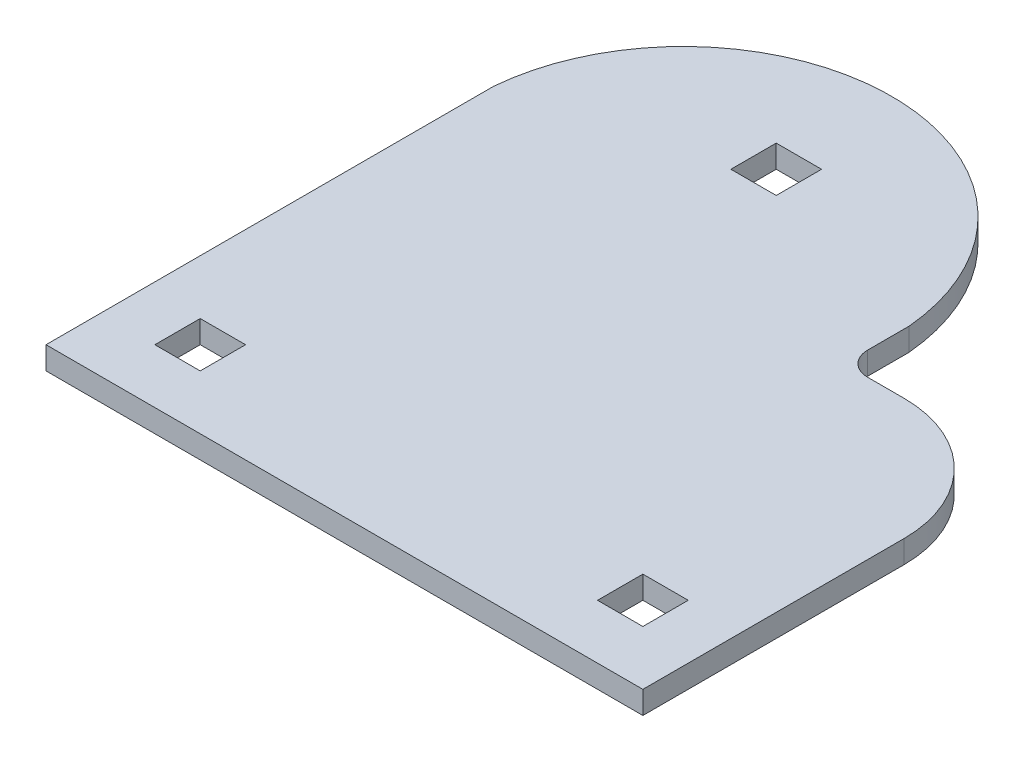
ISO-10303-21;
HEADER;
FILE_DESCRIPTION(('STEP AP214'),'2;1');
FILE_NAME('part.step','',(''),(''),'','','');
FILE_SCHEMA(('AUTOMOTIVE_DESIGN { 1 0 10303 214 1 1 1 1 }'));
ENDSEC;
DATA;
#1=APPLICATION_CONTEXT('core data for automotive mechanical design processes');
#2=APPLICATION_PROTOCOL_DEFINITION('international standard','automotive_design',2000,#1);
#3=PRODUCT_CONTEXT('',#1,'mechanical');
#4=PRODUCT('Part','Part','',(#3));
#5=PRODUCT_RELATED_PRODUCT_CATEGORY('part','',(#4));
#6=PRODUCT_DEFINITION_FORMATION('','',#4);
#7=PRODUCT_DEFINITION_CONTEXT('part definition',#1,'design');
#8=PRODUCT_DEFINITION('design','',#6,#7);
#9=PRODUCT_DEFINITION_SHAPE('','',#8);
#10=(LENGTH_UNIT() NAMED_UNIT(*) SI_UNIT(.MILLI.,.METRE.));
#11=(NAMED_UNIT(*) PLANE_ANGLE_UNIT() SI_UNIT($,.RADIAN.));
#12=(NAMED_UNIT(*) SI_UNIT($,.STERADIAN.) SOLID_ANGLE_UNIT());
#13=UNCERTAINTY_MEASURE_WITH_UNIT(LENGTH_MEASURE(1.E-05),#10,'distance_accuracy_value','');
#14=(GEOMETRIC_REPRESENTATION_CONTEXT(3) GLOBAL_UNCERTAINTY_ASSIGNED_CONTEXT((#13)) GLOBAL_UNIT_ASSIGNED_CONTEXT((#10,
#11,#12)) REPRESENTATION_CONTEXT('',''));
#15=CARTESIAN_POINT('',(0.,0.,0.));
#16=DIRECTION('',(0.,0.,1.));
#17=DIRECTION('',(1.,0.,0.));
#18=AXIS2_PLACEMENT_3D('',#15,#16,#17);
#19=CARTESIAN_POINT('',(6.85799999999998,3.175,0.));
#20=DIRECTION('',(1.,0.,0.));
#21=DIRECTION('',(0.,0.,-1.));
#22=AXIS2_PLACEMENT_3D('',#19,#20,#21);
#23=PLANE('',#22);
#24=DIRECTION('',(0.,0.,1.));
#25=VECTOR('',#24,1.);
#26=CARTESIAN_POINT('',(6.85799999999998,0.,0.));
#27=LINE('',#26,#25);
#28=CARTESIAN_POINT('',(6.858,0.,10.16));
#29=VERTEX_POINT('',#28);
#30=CARTESIAN_POINT('',(6.858,0.,46.7151803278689));
#31=VERTEX_POINT('',#30);
#32=EDGE_CURVE('E284',#29,#31,#27,.T.);
#33=ORIENTED_EDGE('',*,*,#32,.F.);
#34=DIRECTION('',(0.,-1.,0.));
#35=VECTOR('',#34,1.);
#36=CARTESIAN_POINT('',(6.858,3.175,10.16));
#37=LINE('',#36,#35);
#38=CARTESIAN_POINT('',(6.858,3.175,10.16));
#39=VERTEX_POINT('',#38);
#40=EDGE_CURVE('E288',#39,#29,#37,.T.);
#41=ORIENTED_EDGE('',*,*,#40,.F.);
#42=DIRECTION('',(0.,0.,1.));
#43=VECTOR('',#42,1.);
#44=CARTESIAN_POINT('',(6.85799999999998,3.175,0.));
#45=LINE('',#44,#43);
#46=CARTESIAN_POINT('',(6.858,3.175,46.7151803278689));
#47=VERTEX_POINT('',#46);
#48=EDGE_CURVE('E276',#39,#47,#45,.T.);
#49=ORIENTED_EDGE('',*,*,#48,.T.);
#50=DIRECTION('',(0.,-1.,0.));
#51=VECTOR('',#50,1.);
#52=CARTESIAN_POINT('',(6.858,3.175,46.7151803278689));
#53=LINE('',#52,#51);
#54=EDGE_CURVE('E44',#47,#31,#53,.T.);
#55=ORIENTED_EDGE('',*,*,#54,.T.);
#56=EDGE_LOOP('',(#33,#41,#49,#55));
#57=FACE_BOUND('',#56,.T.);
#58=ADVANCED_FACE('F35',(#57),#23,.T.);
#59=CARTESIAN_POINT('',(-76.708,3.175,0.));
#60=DIRECTION('',(1.,0.,0.));
#61=DIRECTION('',(0.,0.,-1.));
#62=AXIS2_PLACEMENT_3D('',#59,#60,#61);
#63=PLANE('',#62);
#64=DIRECTION('',(0.,0.,1.));
#65=VECTOR('',#64,1.);
#66=CARTESIAN_POINT('',(-76.708,0.,0.));
#67=LINE('',#66,#65);
#68=CARTESIAN_POINT('',(-76.708,0.,-15.9537511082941));
#69=VERTEX_POINT('',#68);
#70=CARTESIAN_POINT('',(-76.708,0.,46.7151803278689));
#71=VERTEX_POINT('',#70);
#72=EDGE_CURVE('E287',#69,#71,#67,.T.);
#73=ORIENTED_EDGE('',*,*,#72,.T.);
#74=DIRECTION('',(0.,-1.,0.));
#75=VECTOR('',#74,1.);
#76=CARTESIAN_POINT('',(-76.708,3.175,46.7151803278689));
#77=LINE('',#76,#75);
#78=CARTESIAN_POINT('',(-76.708,3.175,46.7151803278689));
#79=VERTEX_POINT('',#78);
#80=EDGE_CURVE('E11',#79,#71,#77,.T.);
#81=ORIENTED_EDGE('',*,*,#80,.F.);
#82=DIRECTION('',(0.,0.,1.));
#83=VECTOR('',#82,1.);
#84=CARTESIAN_POINT('',(-76.708,3.175,0.));
#85=LINE('',#84,#83);
#86=CARTESIAN_POINT('',(-76.708,3.175,-15.9537511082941));
#87=VERTEX_POINT('',#86);
#88=EDGE_CURVE('E279',#87,#79,#85,.T.);
#89=ORIENTED_EDGE('',*,*,#88,.F.);
#90=DIRECTION('',(0.,-1.,0.));
#91=VECTOR('',#90,1.);
#92=CARTESIAN_POINT('',(-76.708,3.175,-15.9537511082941));
#93=LINE('',#92,#91);
#94=EDGE_CURVE('E39',#87,#69,#93,.T.);
#95=ORIENTED_EDGE('',*,*,#94,.T.);
#96=EDGE_LOOP('',(#73,#81,#89,#95));
#97=FACE_BOUND('',#96,.T.);
#98=ADVANCED_FACE('F333',(#97),#63,.F.);
#99=CARTESIAN_POINT('',(0.,3.175,46.7151803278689));
#100=DIRECTION('',(0.,0.,-1.));
#101=DIRECTION('',(-1.,0.,0.));
#102=AXIS2_PLACEMENT_3D('',#99,#100,#101);
#103=PLANE('',#102);
#104=DIRECTION('',(1.,0.,0.));
#105=VECTOR('',#104,1.);
#106=CARTESIAN_POINT('',(0.,0.,46.7151803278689));
#107=LINE('',#106,#105);
#108=EDGE_CURVE('E280',#71,#31,#107,.T.);
#109=ORIENTED_EDGE('',*,*,#108,.T.);
#110=ORIENTED_EDGE('',*,*,#54,.F.);
#111=DIRECTION('',(1.,0.,0.));
#112=VECTOR('',#111,1.);
#113=CARTESIAN_POINT('',(0.,3.175,46.7151803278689));
#114=LINE('',#113,#112);
#115=EDGE_CURVE('E282',#79,#47,#114,.T.);
#116=ORIENTED_EDGE('',*,*,#115,.F.);
#117=ORIENTED_EDGE('',*,*,#80,.T.);
#118=EDGE_LOOP('',(#109,#110,#116,#117));
#119=FACE_BOUND('',#118,.T.);
#120=ADVANCED_FACE('F360',(#119),#103,.F.);
#121=CARTESIAN_POINT('',(0.,3.175,0.));
#122=DIRECTION('',(0.,1.,0.));
#123=DIRECTION('',(0.,0.,1.));
#124=AXIS2_PLACEMENT_3D('',#121,#122,#123);
#125=PLANE('',#124);
#126=DIRECTION('',(0.,0.,-1.));
#127=VECTOR('',#126,1.);
#128=CARTESIAN_POINT('',(-62.738,3.175,0.));
#129=LINE('',#128,#127);
#130=CARTESIAN_POINT('',(-62.738,3.175,39.0951803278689));
#131=VERTEX_POINT('',#130);
#132=CARTESIAN_POINT('',(-62.738,3.175,32.7451803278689));
#133=VERTEX_POINT('',#132);
#134=EDGE_CURVE('E179',#131,#133,#129,.T.);
#135=ORIENTED_EDGE('',*,*,#134,.F.);
#136=DIRECTION('',(1.,0.,0.));
#137=VECTOR('',#136,1.);
#138=CARTESIAN_POINT('',(0.,3.175,39.0951803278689));
#139=LINE('',#138,#137);
#140=CARTESIAN_POINT('',(-69.088,3.175,39.0951803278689));
#141=VERTEX_POINT('',#140);
#142=EDGE_CURVE('E272',#141,#131,#139,.T.);
#143=ORIENTED_EDGE('',*,*,#142,.F.);
#144=DIRECTION('',(0.,0.,1.));
#145=VECTOR('',#144,1.);
#146=CARTESIAN_POINT('',(-69.088,3.175,0.));
#147=LINE('',#146,#145);
#148=CARTESIAN_POINT('',(-69.088,3.175,32.7451803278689));
#149=VERTEX_POINT('',#148);
#150=EDGE_CURVE('E270',#149,#141,#147,.T.);
#151=ORIENTED_EDGE('',*,*,#150,.F.);
#152=DIRECTION('',(-1.,0.,0.));
#153=VECTOR('',#152,1.);
#154=CARTESIAN_POINT('',(0.,3.175,32.7451803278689));
#155=LINE('',#154,#153);
#156=EDGE_CURVE('E268',#133,#149,#155,.T.);
#157=ORIENTED_EDGE('',*,*,#156,.F.);
#158=EDGE_LOOP('',(#135,#143,#151,#157));
#159=FACE_BOUND('',#158,.T.);
#160=DIRECTION('',(0.,0.,-1.));
#161=VECTOR('',#160,1.);
#162=CARTESIAN_POINT('',(-0.761999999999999,3.175,0.));
#163=LINE('',#162,#161);
#164=CARTESIAN_POINT('',(-0.761999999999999,3.175,39.0951803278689));
#165=VERTEX_POINT('',#164);
#166=CARTESIAN_POINT('',(-0.761999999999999,3.175,32.7451803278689));
#167=VERTEX_POINT('',#166);
#168=EDGE_CURVE('E266',#165,#167,#163,.T.);
#169=ORIENTED_EDGE('',*,*,#168,.F.);
#170=DIRECTION('',(1.,0.,0.));
#171=VECTOR('',#170,1.);
#172=CARTESIAN_POINT('',(0.,3.175,39.0951803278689));
#173=LINE('',#172,#171);
#174=CARTESIAN_POINT('',(-7.11200000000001,3.175,39.0951803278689));
#175=VERTEX_POINT('',#174);
#176=EDGE_CURVE('E264',#175,#165,#173,.T.);
#177=ORIENTED_EDGE('',*,*,#176,.F.);
#178=DIRECTION('',(0.,0.,1.));
#179=VECTOR('',#178,1.);
#180=CARTESIAN_POINT('',(-7.11200000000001,3.175,0.));
#181=LINE('',#180,#179);
#182=CARTESIAN_POINT('',(-7.11200000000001,3.175,32.7451803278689));
#183=VERTEX_POINT('',#182);
#184=EDGE_CURVE('E262',#183,#175,#181,.T.);
#185=ORIENTED_EDGE('',*,*,#184,.F.);
#186=DIRECTION('',(-1.,0.,0.));
#187=VECTOR('',#186,1.);
#188=CARTESIAN_POINT('',(0.,3.175,32.7451803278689));
#189=LINE('',#188,#187);
#190=EDGE_CURVE('E260',#167,#183,#189,.T.);
#191=ORIENTED_EDGE('',*,*,#190,.F.);
#192=EDGE_LOOP('',(#169,#177,#185,#191));
#193=FACE_BOUND('',#192,.T.);
#194=DIRECTION('',(0.,0.,-1.));
#195=VECTOR('',#194,1.);
#196=CARTESIAN_POINT('',(-43.688,3.175,0.));
#197=LINE('',#196,#195);
#198=CARTESIAN_POINT('',(-43.688,3.175,-22.4998196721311));
#199=VERTEX_POINT('',#198);
#200=CARTESIAN_POINT('',(-43.688,3.175,-28.8498196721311));
#201=VERTEX_POINT('',#200);
#202=EDGE_CURVE('E257',#199,#201,#197,.T.);
#203=ORIENTED_EDGE('',*,*,#202,.F.);
#204=DIRECTION('',(1.,0.,0.));
#205=VECTOR('',#204,1.);
#206=CARTESIAN_POINT('',(0.,3.175,-22.4998196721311));
#207=LINE('',#206,#205);
#208=CARTESIAN_POINT('',(-50.038,3.175,-22.4998196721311));
#209=VERTEX_POINT('',#208);
#210=EDGE_CURVE('E255',#209,#199,#207,.T.);
#211=ORIENTED_EDGE('',*,*,#210,.F.);
#212=DIRECTION('',(0.,0.,1.));
#213=VECTOR('',#212,1.);
#214=CARTESIAN_POINT('',(-50.038,3.175,0.));
#215=LINE('',#214,#213);
#216=CARTESIAN_POINT('',(-50.038,3.175,-28.8498196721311));
#217=VERTEX_POINT('',#216);
#218=EDGE_CURVE('E253',#217,#209,#215,.T.);
#219=ORIENTED_EDGE('',*,*,#218,.F.);
#220=DIRECTION('',(-1.,0.,0.));
#221=VECTOR('',#220,1.);
#222=CARTESIAN_POINT('',(0.,3.175,-28.8498196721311));
#223=LINE('',#222,#221);
#224=EDGE_CURVE('E206',#201,#217,#223,.T.);
#225=ORIENTED_EDGE('',*,*,#224,.F.);
#226=EDGE_LOOP('',(#203,#211,#219,#225));
#227=FACE_BOUND('',#226,.T.);
#228=ORIENTED_EDGE('',*,*,#48,.F.);
#229=CARTESIAN_POINT('',(-10.16,3.175,10.16));
#230=DIRECTION('',(0.,1.,0.));
#231=DIRECTION('',(0.,0.,1.));
#232=AXIS2_PLACEMENT_3D('',#229,#230,#231);
#233=CIRCLE('',#232,17.018);
#234=CARTESIAN_POINT('',(-10.16,3.175,-6.858));
#235=VERTEX_POINT('',#234);
#236=EDGE_CURVE('E304',#39,#235,#233,.T.);
#237=ORIENTED_EDGE('',*,*,#236,.T.);
#238=DIRECTION('',(-1.,0.,0.));
#239=VECTOR('',#238,1.);
#240=CARTESIAN_POINT('',(-10.16,3.175,-6.858));
#241=LINE('',#240,#239);
#242=CARTESIAN_POINT('',(-15.24,3.175,-6.858));
#243=VERTEX_POINT('',#242);
#244=EDGE_CURVE('E302',#235,#243,#241,.T.);
#245=ORIENTED_EDGE('',*,*,#244,.T.);
#246=CARTESIAN_POINT('',(-15.24,3.175,-10.16));
#247=DIRECTION('',(0.,-1.,0.));
#248=DIRECTION('',(0.,0.,-1.));
#249=AXIS2_PLACEMENT_3D('',#246,#247,#248);
#250=CIRCLE('',#249,3.302);
#251=CARTESIAN_POINT('',(-18.542,3.175,-10.16));
#252=VERTEX_POINT('',#251);
#253=EDGE_CURVE('E300',#243,#252,#250,.T.);
#254=ORIENTED_EDGE('',*,*,#253,.T.);
#255=DIRECTION('',(0.,0.,1.));
#256=VECTOR('',#255,1.);
#257=CARTESIAN_POINT('',(-18.5419999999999,3.175,-15.9537511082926));
#258=LINE('',#257,#256);
#259=CARTESIAN_POINT('',(-18.5419999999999,3.175,-15.9537511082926));
#260=VERTEX_POINT('',#259);
#261=EDGE_CURVE('E296',#260,#252,#258,.T.);
#262=ORIENTED_EDGE('',*,*,#261,.F.);
#263=CARTESIAN_POINT('',(-47.625,3.175,-13.4125578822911));
#264=DIRECTION('',(0.,1.,0.));
#265=DIRECTION('',(0.,0.,1.));
#266=AXIS2_PLACEMENT_3D('',#263,#264,#265);
#267=CIRCLE('',#266,29.1938101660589);
#268=EDGE_CURVE('E293',#260,#87,#267,.T.);
#269=ORIENTED_EDGE('',*,*,#268,.T.);
#270=ORIENTED_EDGE('',*,*,#88,.T.);
#271=ORIENTED_EDGE('',*,*,#115,.T.);
#272=EDGE_LOOP('',(#228,#237,#245,#254,#262,#269,#270,#271));
#273=FACE_BOUND('',#272,.T.);
#274=ADVANCED_FACE('F363',(#159,#193,#227,#273),#125,.T.);
#275=CARTESIAN_POINT('',(0.,0.,0.));
#276=DIRECTION('',(0.,1.,0.));
#277=DIRECTION('',(0.,0.,1.));
#278=AXIS2_PLACEMENT_3D('',#275,#276,#277);
#279=PLANE('',#278);
#280=DIRECTION('',(1.,0.,0.));
#281=VECTOR('',#280,1.);
#282=CARTESIAN_POINT('',(-69.088,0.,39.0951803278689));
#283=LINE('',#282,#281);
#284=CARTESIAN_POINT('',(-69.088,0.,39.0951803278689));
#285=VERTEX_POINT('',#284);
#286=CARTESIAN_POINT('',(-62.738,0.,39.0951803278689));
#287=VERTEX_POINT('',#286);
#288=EDGE_CURVE('E182',#285,#287,#283,.T.);
#289=ORIENTED_EDGE('',*,*,#288,.T.);
#290=DIRECTION('',(0.,0.,-1.));
#291=VECTOR('',#290,1.);
#292=CARTESIAN_POINT('',(-62.738,0.,39.0951803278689));
#293=LINE('',#292,#291);
#294=CARTESIAN_POINT('',(-62.738,0.,32.7451803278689));
#295=VERTEX_POINT('',#294);
#296=EDGE_CURVE('E176',#287,#295,#293,.T.);
#297=ORIENTED_EDGE('',*,*,#296,.T.);
#298=DIRECTION('',(-1.,0.,0.));
#299=VECTOR('',#298,1.);
#300=CARTESIAN_POINT('',(-69.088,0.,32.7451803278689));
#301=LINE('',#300,#299);
#302=CARTESIAN_POINT('',(-69.088,0.,32.7451803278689));
#303=VERTEX_POINT('',#302);
#304=EDGE_CURVE('E186',#295,#303,#301,.T.);
#305=ORIENTED_EDGE('',*,*,#304,.T.);
#306=DIRECTION('',(0.,0.,1.));
#307=VECTOR('',#306,1.);
#308=CARTESIAN_POINT('',(-69.088,0.,39.0951803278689));
#309=LINE('',#308,#307);
#310=EDGE_CURVE('E191',#303,#285,#309,.T.);
#311=ORIENTED_EDGE('',*,*,#310,.T.);
#312=EDGE_LOOP('',(#289,#297,#305,#311));
#313=FACE_BOUND('',#312,.T.);
#314=DIRECTION('',(1.,0.,0.));
#315=VECTOR('',#314,1.);
#316=CARTESIAN_POINT('',(-0.761999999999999,0.,39.0951803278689));
#317=LINE('',#316,#315);
#318=CARTESIAN_POINT('',(-7.11200000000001,0.,39.0951803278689));
#319=VERTEX_POINT('',#318);
#320=CARTESIAN_POINT('',(-0.761999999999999,0.,39.0951803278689));
#321=VERTEX_POINT('',#320);
#322=EDGE_CURVE('E221',#319,#321,#317,.T.);
#323=ORIENTED_EDGE('',*,*,#322,.T.);
#324=DIRECTION('',(0.,0.,-1.));
#325=VECTOR('',#324,1.);
#326=CARTESIAN_POINT('',(-0.761999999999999,0.,39.0951803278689));
#327=LINE('',#326,#325);
#328=CARTESIAN_POINT('',(-0.761999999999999,0.,32.7451803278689));
#329=VERTEX_POINT('',#328);
#330=EDGE_CURVE('E211',#321,#329,#327,.T.);
#331=ORIENTED_EDGE('',*,*,#330,.T.);
#332=DIRECTION('',(-1.,0.,0.));
#333=VECTOR('',#332,1.);
#334=CARTESIAN_POINT('',(-0.761999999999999,0.,32.7451803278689));
#335=LINE('',#334,#333);
#336=CARTESIAN_POINT('',(-7.11200000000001,0.,32.7451803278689));
#337=VERTEX_POINT('',#336);
#338=EDGE_CURVE('E214',#329,#337,#335,.T.);
#339=ORIENTED_EDGE('',*,*,#338,.T.);
#340=DIRECTION('',(0.,0.,1.));
#341=VECTOR('',#340,1.);
#342=CARTESIAN_POINT('',(-7.11200000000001,0.,39.0951803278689));
#343=LINE('',#342,#341);
#344=EDGE_CURVE('E218',#337,#319,#343,.T.);
#345=ORIENTED_EDGE('',*,*,#344,.T.);
#346=EDGE_LOOP('',(#323,#331,#339,#345));
#347=FACE_BOUND('',#346,.T.);
#348=DIRECTION('',(1.,0.,0.));
#349=VECTOR('',#348,1.);
#350=CARTESIAN_POINT('',(-50.038,0.,-22.4998196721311));
#351=LINE('',#350,#349);
#352=CARTESIAN_POINT('',(-50.038,0.,-22.4998196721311));
#353=VERTEX_POINT('',#352);
#354=CARTESIAN_POINT('',(-43.688,0.,-22.4998196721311));
#355=VERTEX_POINT('',#354);
#356=EDGE_CURVE('E239',#353,#355,#351,.T.);
#357=ORIENTED_EDGE('',*,*,#356,.T.);
#358=DIRECTION('',(0.,0.,-1.));
#359=VECTOR('',#358,1.);
#360=CARTESIAN_POINT('',(-43.688,0.,-28.8498196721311));
#361=LINE('',#360,#359);
#362=CARTESIAN_POINT('',(-43.688,0.,-28.8498196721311));
#363=VERTEX_POINT('',#362);
#364=EDGE_CURVE('E230',#355,#363,#361,.T.);
#365=ORIENTED_EDGE('',*,*,#364,.T.);
#366=DIRECTION('',(-1.,0.,0.));
#367=VECTOR('',#366,1.);
#368=CARTESIAN_POINT('',(-50.038,0.,-28.8498196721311));
#369=LINE('',#368,#367);
#370=CARTESIAN_POINT('',(-50.038,0.,-28.8498196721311));
#371=VERTEX_POINT('',#370);
#372=EDGE_CURVE('E233',#363,#371,#369,.T.);
#373=ORIENTED_EDGE('',*,*,#372,.T.);
#374=DIRECTION('',(0.,0.,1.));
#375=VECTOR('',#374,1.);
#376=CARTESIAN_POINT('',(-50.038,0.,-28.8498196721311));
#377=LINE('',#376,#375);
#378=EDGE_CURVE('E236',#371,#353,#377,.T.);
#379=ORIENTED_EDGE('',*,*,#378,.T.);
#380=EDGE_LOOP('',(#357,#365,#373,#379));
#381=FACE_BOUND('',#380,.T.);
#382=ORIENTED_EDGE('',*,*,#32,.T.);
#383=ORIENTED_EDGE('',*,*,#108,.F.);
#384=ORIENTED_EDGE('',*,*,#72,.F.);
#385=CARTESIAN_POINT('',(-47.625,0.,-13.4125578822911));
#386=DIRECTION('',(0.,1.,0.));
#387=DIRECTION('',(0.,0.,1.));
#388=AXIS2_PLACEMENT_3D('',#385,#386,#387);
#389=CIRCLE('',#388,29.1938101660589);
#390=CARTESIAN_POINT('',(-18.5419999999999,0.,-15.9537511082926));
#391=VERTEX_POINT('',#390);
#392=EDGE_CURVE('E275',#391,#69,#389,.T.);
#393=ORIENTED_EDGE('',*,*,#392,.F.);
#394=DIRECTION('',(0.,0.,1.));
#395=VECTOR('',#394,1.);
#396=CARTESIAN_POINT('',(-18.5419999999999,0.,-15.9537511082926));
#397=LINE('',#396,#395);
#398=CARTESIAN_POINT('',(-18.542,0.,-10.16));
#399=VERTEX_POINT('',#398);
#400=EDGE_CURVE('E308',#391,#399,#397,.T.);
#401=ORIENTED_EDGE('',*,*,#400,.T.);
#402=CARTESIAN_POINT('',(-15.24,0.,-10.16));
#403=DIRECTION('',(0.,-1.,0.));
#404=DIRECTION('',(0.,0.,-1.));
#405=AXIS2_PLACEMENT_3D('',#402,#403,#404);
#406=CIRCLE('',#405,3.302);
#407=CARTESIAN_POINT('',(-15.24,0.,-6.858));
#408=VERTEX_POINT('',#407);
#409=EDGE_CURVE('E311',#408,#399,#406,.T.);
#410=ORIENTED_EDGE('',*,*,#409,.F.);
#411=DIRECTION('',(-1.,0.,0.));
#412=VECTOR('',#411,1.);
#413=CARTESIAN_POINT('',(-10.16,0.,-6.858));
#414=LINE('',#413,#412);
#415=CARTESIAN_POINT('',(-10.16,0.,-6.858));
#416=VERTEX_POINT('',#415);
#417=EDGE_CURVE('E314',#416,#408,#414,.T.);
#418=ORIENTED_EDGE('',*,*,#417,.F.);
#419=CARTESIAN_POINT('',(-10.16,0.,10.16));
#420=DIRECTION('',(0.,1.,0.));
#421=DIRECTION('',(0.,0.,1.));
#422=AXIS2_PLACEMENT_3D('',#419,#420,#421);
#423=CIRCLE('',#422,17.018);
#424=EDGE_CURVE('E297',#29,#416,#423,.T.);
#425=ORIENTED_EDGE('',*,*,#424,.F.);
#426=EDGE_LOOP('',(#382,#383,#384,#393,#401,#410,#418,#425));
#427=FACE_BOUND('',#426,.T.);
#428=ADVANCED_FACE('F193',(#313,#347,#381,#427),#279,.F.);
#429=CARTESIAN_POINT('',(-47.625,3.175,-13.4125578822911));
#430=DIRECTION('',(0.,-1.,0.));
#431=DIRECTION('',(0.,0.,-1.));
#432=AXIS2_PLACEMENT_3D('',#429,#430,#431);
#433=CYLINDRICAL_SURFACE('',#432,29.1938101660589);
#434=ORIENTED_EDGE('',*,*,#392,.T.);
#435=ORIENTED_EDGE('',*,*,#94,.F.);
#436=ORIENTED_EDGE('',*,*,#268,.F.);
#437=DIRECTION('',(0.,-1.,0.));
#438=VECTOR('',#437,1.);
#439=CARTESIAN_POINT('',(-18.5419999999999,3.175,-15.9537511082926));
#440=LINE('',#439,#438);
#441=EDGE_CURVE('E326',#260,#391,#440,.T.);
#442=ORIENTED_EDGE('',*,*,#441,.T.);
#443=EDGE_LOOP('',(#434,#435,#436,#442));
#444=FACE_BOUND('',#443,.T.);
#445=ADVANCED_FACE('F37',(#444),#433,.T.);
#446=CARTESIAN_POINT('',(-18.5419999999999,3.175,-15.9537511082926));
#447=DIRECTION('',(1.,0.,0.));
#448=DIRECTION('',(0.,0.,-1.));
#449=AXIS2_PLACEMENT_3D('',#446,#447,#448);
#450=PLANE('',#449);
#451=ORIENTED_EDGE('',*,*,#400,.F.);
#452=ORIENTED_EDGE('',*,*,#441,.F.);
#453=ORIENTED_EDGE('',*,*,#261,.T.);
#454=DIRECTION('',(0.,-1.,0.));
#455=VECTOR('',#454,1.);
#456=CARTESIAN_POINT('',(-18.542,3.175,-10.16));
#457=LINE('',#456,#455);
#458=EDGE_CURVE('E325',#252,#399,#457,.T.);
#459=ORIENTED_EDGE('',*,*,#458,.T.);
#460=EDGE_LOOP('',(#451,#452,#453,#459));
#461=FACE_BOUND('',#460,.T.);
#462=ADVANCED_FACE('F340',(#461),#450,.T.);
#463=CARTESIAN_POINT('',(-15.24,3.175,-10.16));
#464=DIRECTION('',(0.,-1.,0.));
#465=DIRECTION('',(0.,0.,-1.));
#466=AXIS2_PLACEMENT_3D('',#463,#464,#465);
#467=CYLINDRICAL_SURFACE('',#466,3.302);
#468=ORIENTED_EDGE('',*,*,#409,.T.);
#469=ORIENTED_EDGE('',*,*,#458,.F.);
#470=ORIENTED_EDGE('',*,*,#253,.F.);
#471=DIRECTION('',(0.,-1.,0.));
#472=VECTOR('',#471,1.);
#473=CARTESIAN_POINT('',(-15.24,3.175,-6.858));
#474=LINE('',#473,#472);
#475=EDGE_CURVE('E322',#243,#408,#474,.T.);
#476=ORIENTED_EDGE('',*,*,#475,.T.);
#477=EDGE_LOOP('',(#468,#469,#470,#476));
#478=FACE_BOUND('',#477,.T.);
#479=ADVANCED_FACE('F345',(#478),#467,.F.);
#480=CARTESIAN_POINT('',(-10.16,3.175,-6.858));
#481=DIRECTION('',(0.,0.,1.));
#482=DIRECTION('',(1.,0.,0.));
#483=AXIS2_PLACEMENT_3D('',#480,#481,#482);
#484=PLANE('',#483);
#485=ORIENTED_EDGE('',*,*,#417,.T.);
#486=ORIENTED_EDGE('',*,*,#475,.F.);
#487=ORIENTED_EDGE('',*,*,#244,.F.);
#488=DIRECTION('',(0.,-1.,0.));
#489=VECTOR('',#488,1.);
#490=CARTESIAN_POINT('',(-10.16,3.175,-6.858));
#491=LINE('',#490,#489);
#492=EDGE_CURVE('E319',#235,#416,#491,.T.);
#493=ORIENTED_EDGE('',*,*,#492,.T.);
#494=EDGE_LOOP('',(#485,#486,#487,#493));
#495=FACE_BOUND('',#494,.T.);
#496=ADVANCED_FACE('F350',(#495),#484,.F.);
#497=CARTESIAN_POINT('',(-10.16,3.175,10.16));
#498=DIRECTION('',(0.,-1.,0.));
#499=DIRECTION('',(0.,0.,-1.));
#500=AXIS2_PLACEMENT_3D('',#497,#498,#499);
#501=CYLINDRICAL_SURFACE('',#500,17.018);
#502=ORIENTED_EDGE('',*,*,#424,.T.);
#503=ORIENTED_EDGE('',*,*,#492,.F.);
#504=ORIENTED_EDGE('',*,*,#236,.F.);
#505=ORIENTED_EDGE('',*,*,#40,.T.);
#506=EDGE_LOOP('',(#502,#503,#504,#505));
#507=FACE_BOUND('',#506,.T.);
#508=ADVANCED_FACE('F355',(#507),#501,.T.);
#509=CARTESIAN_POINT('',(-43.688,0.,-28.8498196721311));
#510=DIRECTION('',(1.,0.,0.));
#511=DIRECTION('',(0.,0.,-1.));
#512=AXIS2_PLACEMENT_3D('',#509,#510,#511);
#513=PLANE('',#512);
#514=ORIENTED_EDGE('',*,*,#202,.T.);
#515=DIRECTION('',(0.,1.,0.));
#516=VECTOR('',#515,1.);
#517=CARTESIAN_POINT('',(-43.688,0.,-28.8498196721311));
#518=LINE('',#517,#516);
#519=EDGE_CURVE('E242',#363,#201,#518,.T.);
#520=ORIENTED_EDGE('',*,*,#519,.F.);
#521=ORIENTED_EDGE('',*,*,#364,.F.);
#522=DIRECTION('',(0.,1.,0.));
#523=VECTOR('',#522,1.);
#524=CARTESIAN_POINT('',(-43.688,0.,-22.4998196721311));
#525=LINE('',#524,#523);
#526=EDGE_CURVE('E215',#355,#199,#525,.T.);
#527=ORIENTED_EDGE('',*,*,#526,.T.);
#528=EDGE_LOOP('',(#514,#520,#521,#527));
#529=FACE_BOUND('',#528,.T.);
#530=ADVANCED_FACE('F372',(#529),#513,.F.);
#531=CARTESIAN_POINT('',(-50.038,0.,-22.4998196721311));
#532=DIRECTION('',(0.,0.,1.));
#533=DIRECTION('',(1.,0.,0.));
#534=AXIS2_PLACEMENT_3D('',#531,#532,#533);
#535=PLANE('',#534);
#536=ORIENTED_EDGE('',*,*,#210,.T.);
#537=ORIENTED_EDGE('',*,*,#526,.F.);
#538=ORIENTED_EDGE('',*,*,#356,.F.);
#539=DIRECTION('',(0.,1.,0.));
#540=VECTOR('',#539,1.);
#541=CARTESIAN_POINT('',(-50.038,0.,-22.4998196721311));
#542=LINE('',#541,#540);
#543=EDGE_CURVE('E245',#353,#209,#542,.T.);
#544=ORIENTED_EDGE('',*,*,#543,.T.);
#545=EDGE_LOOP('',(#536,#537,#538,#544));
#546=FACE_BOUND('',#545,.T.);
#547=ADVANCED_FACE('F382',(#546),#535,.F.);
#548=CARTESIAN_POINT('',(-50.038,0.,-28.8498196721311));
#549=DIRECTION('',(-1.,0.,0.));
#550=DIRECTION('',(0.,0.,1.));
#551=AXIS2_PLACEMENT_3D('',#548,#549,#550);
#552=PLANE('',#551);
#553=ORIENTED_EDGE('',*,*,#218,.T.);
#554=ORIENTED_EDGE('',*,*,#543,.F.);
#555=ORIENTED_EDGE('',*,*,#378,.F.);
#556=DIRECTION('',(0.,1.,0.));
#557=VECTOR('',#556,1.);
#558=CARTESIAN_POINT('',(-50.038,0.,-28.8498196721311));
#559=LINE('',#558,#557);
#560=EDGE_CURVE('E248',#371,#217,#559,.T.);
#561=ORIENTED_EDGE('',*,*,#560,.T.);
#562=EDGE_LOOP('',(#553,#554,#555,#561));
#563=FACE_BOUND('',#562,.T.);
#564=ADVANCED_FACE('F432',(#563),#552,.F.);
#565=CARTESIAN_POINT('',(-50.038,0.,-28.8498196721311));
#566=DIRECTION('',(0.,0.,-1.));
#567=DIRECTION('',(-1.,0.,0.));
#568=AXIS2_PLACEMENT_3D('',#565,#566,#567);
#569=PLANE('',#568);
#570=ORIENTED_EDGE('',*,*,#224,.T.);
#571=ORIENTED_EDGE('',*,*,#560,.F.);
#572=ORIENTED_EDGE('',*,*,#372,.F.);
#573=ORIENTED_EDGE('',*,*,#519,.T.);
#574=EDGE_LOOP('',(#570,#571,#572,#573));
#575=FACE_BOUND('',#574,.T.);
#576=ADVANCED_FACE('F442',(#575),#569,.F.);
#577=CARTESIAN_POINT('',(-0.761999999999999,0.,39.0951803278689));
#578=DIRECTION('',(1.,0.,0.));
#579=DIRECTION('',(0.,0.,-1.));
#580=AXIS2_PLACEMENT_3D('',#577,#578,#579);
#581=PLANE('',#580);
#582=ORIENTED_EDGE('',*,*,#168,.T.);
#583=DIRECTION('',(0.,1.,0.));
#584=VECTOR('',#583,1.);
#585=CARTESIAN_POINT('',(-0.761999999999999,0.,32.7451803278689));
#586=LINE('',#585,#584);
#587=EDGE_CURVE('E60',#329,#167,#586,.T.);
#588=ORIENTED_EDGE('',*,*,#587,.F.);
#589=ORIENTED_EDGE('',*,*,#330,.F.);
#590=DIRECTION('',(0.,1.,0.));
#591=VECTOR('',#590,1.);
#592=CARTESIAN_POINT('',(-0.761999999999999,0.,39.0951803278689));
#593=LINE('',#592,#591);
#594=EDGE_CURVE('E196',#321,#165,#593,.T.);
#595=ORIENTED_EDGE('',*,*,#594,.T.);
#596=EDGE_LOOP('',(#582,#588,#589,#595));
#597=FACE_BOUND('',#596,.T.);
#598=ADVANCED_FACE('F452',(#597),#581,.F.);
#599=CARTESIAN_POINT('',(-0.761999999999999,0.,39.0951803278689));
#600=DIRECTION('',(0.,0.,1.));
#601=DIRECTION('',(1.,0.,0.));
#602=AXIS2_PLACEMENT_3D('',#599,#600,#601);
#603=PLANE('',#602);
#604=ORIENTED_EDGE('',*,*,#176,.T.);
#605=ORIENTED_EDGE('',*,*,#594,.F.);
#606=ORIENTED_EDGE('',*,*,#322,.F.);
#607=DIRECTION('',(0.,1.,0.));
#608=VECTOR('',#607,1.);
#609=CARTESIAN_POINT('',(-7.11200000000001,0.,39.0951803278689));
#610=LINE('',#609,#608);
#611=EDGE_CURVE('E199',#319,#175,#610,.T.);
#612=ORIENTED_EDGE('',*,*,#611,.T.);
#613=EDGE_LOOP('',(#604,#605,#606,#612));
#614=FACE_BOUND('',#613,.T.);
#615=ADVANCED_FACE('F462',(#614),#603,.F.);
#616=CARTESIAN_POINT('',(-7.11200000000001,0.,39.0951803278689));
#617=DIRECTION('',(-1.,0.,0.));
#618=DIRECTION('',(0.,0.,1.));
#619=AXIS2_PLACEMENT_3D('',#616,#617,#618);
#620=PLANE('',#619);
#621=ORIENTED_EDGE('',*,*,#184,.T.);
#622=ORIENTED_EDGE('',*,*,#611,.F.);
#623=ORIENTED_EDGE('',*,*,#344,.F.);
#624=DIRECTION('',(0.,1.,0.));
#625=VECTOR('',#624,1.);
#626=CARTESIAN_POINT('',(-7.11200000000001,0.,32.7451803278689));
#627=LINE('',#626,#625);
#628=EDGE_CURVE('E226',#337,#183,#627,.T.);
#629=ORIENTED_EDGE('',*,*,#628,.T.);
#630=EDGE_LOOP('',(#621,#622,#623,#629));
#631=FACE_BOUND('',#630,.T.);
#632=ADVANCED_FACE('F472',(#631),#620,.F.);
#633=CARTESIAN_POINT('',(-0.761999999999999,0.,32.7451803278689));
#634=DIRECTION('',(0.,0.,-1.));
#635=DIRECTION('',(-1.,0.,0.));
#636=AXIS2_PLACEMENT_3D('',#633,#634,#635);
#637=PLANE('',#636);
#638=ORIENTED_EDGE('',*,*,#190,.T.);
#639=ORIENTED_EDGE('',*,*,#628,.F.);
#640=ORIENTED_EDGE('',*,*,#338,.F.);
#641=ORIENTED_EDGE('',*,*,#587,.T.);
#642=EDGE_LOOP('',(#638,#639,#640,#641));
#643=FACE_BOUND('',#642,.T.);
#644=ADVANCED_FACE('F482',(#643),#637,.F.);
#645=CARTESIAN_POINT('',(-62.738,0.,39.0951803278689));
#646=DIRECTION('',(1.,0.,0.));
#647=DIRECTION('',(0.,0.,-1.));
#648=AXIS2_PLACEMENT_3D('',#645,#646,#647);
#649=PLANE('',#648);
#650=ORIENTED_EDGE('',*,*,#134,.T.);
#651=DIRECTION('',(0.,1.,0.));
#652=VECTOR('',#651,1.);
#653=CARTESIAN_POINT('',(-62.738,0.,32.7451803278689));
#654=LINE('',#653,#652);
#655=EDGE_CURVE('E52',#295,#133,#654,.T.);
#656=ORIENTED_EDGE('',*,*,#655,.F.);
#657=ORIENTED_EDGE('',*,*,#296,.F.);
#658=DIRECTION('',(0.,1.,0.));
#659=VECTOR('',#658,1.);
#660=CARTESIAN_POINT('',(-62.738,0.,39.0951803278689));
#661=LINE('',#660,#659);
#662=EDGE_CURVE('E204',#287,#131,#661,.T.);
#663=ORIENTED_EDGE('',*,*,#662,.T.);
#664=EDGE_LOOP('',(#650,#656,#657,#663));
#665=FACE_BOUND('',#664,.T.);
#666=ADVANCED_FACE('F173',(#665),#649,.F.);
#667=CARTESIAN_POINT('',(-69.088,0.,39.0951803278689));
#668=DIRECTION('',(0.,0.,1.));
#669=DIRECTION('',(1.,0.,0.));
#670=AXIS2_PLACEMENT_3D('',#667,#668,#669);
#671=PLANE('',#670);
#672=ORIENTED_EDGE('',*,*,#142,.T.);
#673=ORIENTED_EDGE('',*,*,#662,.F.);
#674=ORIENTED_EDGE('',*,*,#288,.F.);
#675=DIRECTION('',(0.,1.,0.));
#676=VECTOR('',#675,1.);
#677=CARTESIAN_POINT('',(-69.088,0.,39.0951803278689));
#678=LINE('',#677,#676);
#679=EDGE_CURVE('E207',#285,#141,#678,.T.);
#680=ORIENTED_EDGE('',*,*,#679,.T.);
#681=EDGE_LOOP('',(#672,#673,#674,#680));
#682=FACE_BOUND('',#681,.T.);
#683=ADVANCED_FACE('F500',(#682),#671,.F.);
#684=CARTESIAN_POINT('',(-69.088,0.,39.0951803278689));
#685=DIRECTION('',(-1.,0.,0.));
#686=DIRECTION('',(0.,0.,1.));
#687=AXIS2_PLACEMENT_3D('',#684,#685,#686);
#688=PLANE('',#687);
#689=ORIENTED_EDGE('',*,*,#150,.T.);
#690=ORIENTED_EDGE('',*,*,#679,.F.);
#691=ORIENTED_EDGE('',*,*,#310,.F.);
#692=DIRECTION('',(0.,1.,0.));
#693=VECTOR('',#692,1.);
#694=CARTESIAN_POINT('',(-69.088,0.,32.7451803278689));
#695=LINE('',#694,#693);
#696=EDGE_CURVE('E181',#303,#149,#695,.T.);
#697=ORIENTED_EDGE('',*,*,#696,.T.);
#698=EDGE_LOOP('',(#689,#690,#691,#697));
#699=FACE_BOUND('',#698,.T.);
#700=ADVANCED_FACE('F509',(#699),#688,.F.);
#701=CARTESIAN_POINT('',(-69.088,0.,32.7451803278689));
#702=DIRECTION('',(0.,0.,-1.));
#703=DIRECTION('',(-1.,0.,0.));
#704=AXIS2_PLACEMENT_3D('',#701,#702,#703);
#705=PLANE('',#704);
#706=ORIENTED_EDGE('',*,*,#156,.T.);
#707=ORIENTED_EDGE('',*,*,#696,.F.);
#708=ORIENTED_EDGE('',*,*,#304,.F.);
#709=ORIENTED_EDGE('',*,*,#655,.T.);
#710=EDGE_LOOP('',(#706,#707,#708,#709));
#711=FACE_BOUND('',#710,.T.);
#712=ADVANCED_FACE('F187',(#711),#705,.F.);
#713=CLOSED_SHELL('',(#58,#98,#120,#274,#428,#445,#462,#479,#496,#508,#530,#547,#564,#576,#598,
#615,#632,#644,#666,#683,#700,#712));
#714=MANIFOLD_SOLID_BREP('B2',#713);
#715=ADVANCED_BREP_SHAPE_REPRESENTATION('',(#18,#714),#14);
#716=SHAPE_DEFINITION_REPRESENTATION(#9,#715);
ENDSEC;
END-ISO-10303-21;
